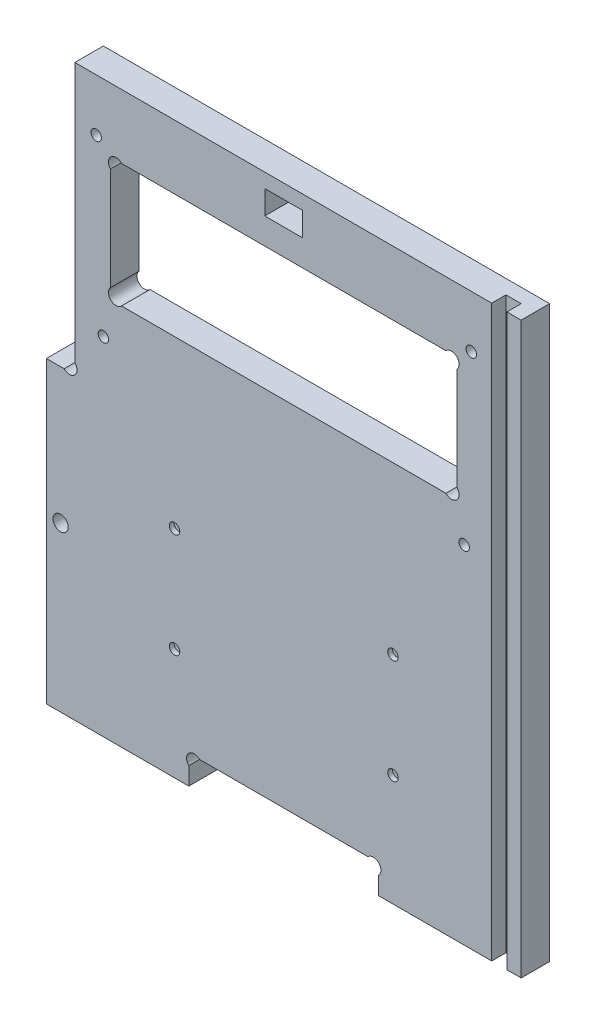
ISO-10303-21;
HEADER;
FILE_DESCRIPTION(('STEP AP214'),'2;1');
FILE_NAME('part.step','',(''),(''),'','','');
FILE_SCHEMA(('AUTOMOTIVE_DESIGN { 1 0 10303 214 1 1 1 1 }'));
ENDSEC;
DATA;
#1=APPLICATION_CONTEXT('core data for automotive mechanical design processes');
#2=APPLICATION_PROTOCOL_DEFINITION('international standard','automotive_design',2000,#1);
#3=PRODUCT_CONTEXT('',#1,'mechanical');
#4=PRODUCT('Part','Part','',(#3));
#5=PRODUCT_RELATED_PRODUCT_CATEGORY('part','',(#4));
#6=PRODUCT_DEFINITION_FORMATION('','',#4);
#7=PRODUCT_DEFINITION_CONTEXT('part definition',#1,'design');
#8=PRODUCT_DEFINITION('design','',#6,#7);
#9=PRODUCT_DEFINITION_SHAPE('','',#8);
#10=(LENGTH_UNIT() NAMED_UNIT(*) SI_UNIT(.MILLI.,.METRE.));
#11=(NAMED_UNIT(*) PLANE_ANGLE_UNIT() SI_UNIT($,.RADIAN.));
#12=(NAMED_UNIT(*) SI_UNIT($,.STERADIAN.) SOLID_ANGLE_UNIT());
#13=UNCERTAINTY_MEASURE_WITH_UNIT(LENGTH_MEASURE(1.E-05),#10,'distance_accuracy_value','');
#14=(GEOMETRIC_REPRESENTATION_CONTEXT(3) GLOBAL_UNCERTAINTY_ASSIGNED_CONTEXT((#13)) GLOBAL_UNIT_ASSIGNED_CONTEXT((#10,
#11,#12)) REPRESENTATION_CONTEXT('',''));
#15=CARTESIAN_POINT('',(0.,0.,0.));
#16=DIRECTION('',(0.,0.,1.));
#17=DIRECTION('',(1.,0.,0.));
#18=AXIS2_PLACEMENT_3D('',#15,#16,#17);
#19=CARTESIAN_POINT('',(18.8686291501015,-1.13137084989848,6.));
#20=DIRECTION('',(0.,0.,1.));
#21=DIRECTION('',(1.,0.,0.));
#22=AXIS2_PLACEMENT_3D('',#19,#20,#21);
#23=PLANE('',#22);
#24=DIRECTION('',(0.,-1.,0.));
#25=VECTOR('',#24,1.);
#26=CARTESIAN_POINT('',(43.8,117.181589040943,6.));
#27=LINE('',#26,#25);
#28=CARTESIAN_POINT('',(43.8,114.,6.));
#29=VERTEX_POINT('',#28);
#30=CARTESIAN_POINT('',(43.8,-5.99999999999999,6.));
#31=VERTEX_POINT('',#30);
#32=EDGE_CURVE('E229',#29,#31,#27,.T.);
#33=ORIENTED_EDGE('',*,*,#32,.F.);
#34=DIRECTION('',(-1.,0.,0.));
#35=VECTOR('',#34,1.);
#36=CARTESIAN_POINT('',(-44.,114.,6.));
#37=LINE('',#36,#35);
#38=CARTESIAN_POINT('',(-44.,114.,6.));
#39=VERTEX_POINT('',#38);
#40=EDGE_CURVE('E239',#29,#39,#37,.T.);
#41=ORIENTED_EDGE('',*,*,#40,.T.);
#42=DIRECTION('',(0.,-1.,0.));
#43=VECTOR('',#42,1.);
#44=CARTESIAN_POINT('',(-44.,59.2627416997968,6.));
#45=LINE('',#44,#43);
#46=CARTESIAN_POINT('',(-44.,59.2627416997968,6.));
#47=VERTEX_POINT('',#46);
#48=EDGE_CURVE('E253',#39,#47,#45,.T.);
#49=ORIENTED_EDGE('',*,*,#48,.T.);
#50=CARTESIAN_POINT('',(-45.1313708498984,58.1313708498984,6.));
#51=DIRECTION('',(0.,0.,-1.));
#52=DIRECTION('',(-1.,0.,0.));
#53=AXIS2_PLACEMENT_3D('',#50,#51,#52);
#54=CIRCLE('',#53,1.59999999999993);
#55=CARTESIAN_POINT('',(-46.2627416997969,57.,6.));
#56=VERTEX_POINT('',#55);
#57=EDGE_CURVE('E258',#47,#56,#54,.T.);
#58=ORIENTED_EDGE('',*,*,#57,.T.);
#59=DIRECTION('',(-1.,0.,0.));
#60=VECTOR('',#59,1.);
#61=CARTESIAN_POINT('',(-46.2627416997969,57.,6.));
#62=LINE('',#61,#60);
#63=CARTESIAN_POINT('',(-50.,57.,6.));
#64=VERTEX_POINT('',#63);
#65=EDGE_CURVE('E260',#56,#64,#62,.T.);
#66=ORIENTED_EDGE('',*,*,#65,.T.);
#67=DIRECTION('',(0.,-1.,0.));
#68=VECTOR('',#67,1.);
#69=CARTESIAN_POINT('',(-50.,57.,6.));
#70=LINE('',#69,#68);
#71=CARTESIAN_POINT('',(-50.,-6.,6.));
#72=VERTEX_POINT('',#71);
#73=EDGE_CURVE('E262',#64,#72,#70,.T.);
#74=ORIENTED_EDGE('',*,*,#73,.T.);
#75=DIRECTION('',(1.,0.,0.));
#76=VECTOR('',#75,1.);
#77=CARTESIAN_POINT('',(-20.,-6.,6.));
#78=LINE('',#77,#76);
#79=CARTESIAN_POINT('',(-20.,-6.,6.));
#80=VERTEX_POINT('',#79);
#81=EDGE_CURVE('E264',#72,#80,#78,.T.);
#82=ORIENTED_EDGE('',*,*,#81,.T.);
#83=DIRECTION('',(0.,1.,0.));
#84=VECTOR('',#83,1.);
#85=CARTESIAN_POINT('',(-20.,-2.26274169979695,6.));
#86=LINE('',#85,#84);
#87=CARTESIAN_POINT('',(-20.,-2.26274169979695,6.));
#88=VERTEX_POINT('',#87);
#89=EDGE_CURVE('E266',#80,#88,#86,.T.);
#90=ORIENTED_EDGE('',*,*,#89,.T.);
#91=CARTESIAN_POINT('',(-18.8686291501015,-1.13137084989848,6.));
#92=DIRECTION('',(0.,0.,-1.));
#93=DIRECTION('',(-1.,0.,0.));
#94=AXIS2_PLACEMENT_3D('',#91,#92,#93);
#95=CIRCLE('',#94,1.6);
#96=CARTESIAN_POINT('',(-17.737258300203,0.,6.));
#97=VERTEX_POINT('',#96);
#98=EDGE_CURVE('E268',#88,#97,#95,.T.);
#99=ORIENTED_EDGE('',*,*,#98,.T.);
#100=DIRECTION('',(1.,0.,0.));
#101=VECTOR('',#100,1.);
#102=CARTESIAN_POINT('',(17.737258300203,0.,6.));
#103=LINE('',#102,#101);
#104=CARTESIAN_POINT('',(17.737258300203,0.,6.));
#105=VERTEX_POINT('',#104);
#106=EDGE_CURVE('E270',#97,#105,#103,.T.);
#107=ORIENTED_EDGE('',*,*,#106,.T.);
#108=CARTESIAN_POINT('',(18.8686291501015,-1.13137084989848,6.));
#109=DIRECTION('',(0.,0.,-1.));
#110=DIRECTION('',(1.,0.,0.));
#111=AXIS2_PLACEMENT_3D('',#108,#109,#110);
#112=CIRCLE('',#111,1.6);
#113=CARTESIAN_POINT('',(20.,-2.26274169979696,6.));
#114=VERTEX_POINT('',#113);
#115=EDGE_CURVE('E272',#105,#114,#112,.T.);
#116=ORIENTED_EDGE('',*,*,#115,.T.);
#117=DIRECTION('',(0.,-1.,0.));
#118=VECTOR('',#117,1.);
#119=CARTESIAN_POINT('',(20.,-6.,6.));
#120=LINE('',#119,#118);
#121=CARTESIAN_POINT('',(20.,-6.,6.));
#122=VERTEX_POINT('',#121);
#123=EDGE_CURVE('E274',#114,#122,#120,.T.);
#124=ORIENTED_EDGE('',*,*,#123,.T.);
#125=DIRECTION('',(1.,0.,0.));
#126=VECTOR('',#125,1.);
#127=CARTESIAN_POINT('',(50.,-6.,6.));
#128=LINE('',#127,#126);
#129=EDGE_CURVE('E242',#122,#31,#128,.T.);
#130=ORIENTED_EDGE('',*,*,#129,.T.);
#131=EDGE_LOOP('',(#33,#41,#49,#58,#66,#74,#82,#90,#99,#107,#116,#124,#130));
#132=FACE_BOUND('',#131,.T.);
#133=CARTESIAN_POINT('',(-23.0000000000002,17.5,6.));
#134=DIRECTION('',(0.,0.,-1.));
#135=DIRECTION('',(-1.,0.,0.));
#136=AXIS2_PLACEMENT_3D('',#133,#134,#135);
#137=CIRCLE('',#136,1.09999999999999);
#138=CARTESIAN_POINT('',(-24.1000000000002,17.5,6.));
#139=VERTEX_POINT('',#138);
#140=EDGE_CURVE('E549',#139,#139,#137,.T.);
#141=ORIENTED_EDGE('',*,*,#140,.T.);
#142=EDGE_LOOP('',(#141));
#143=FACE_BOUND('',#142,.T.);
#144=CARTESIAN_POINT('',(-23.,39.5,6.));
#145=DIRECTION('',(0.,0.,-1.));
#146=DIRECTION('',(-1.,0.,0.));
#147=AXIS2_PLACEMENT_3D('',#144,#145,#146);
#148=CIRCLE('',#147,1.09999999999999);
#149=CARTESIAN_POINT('',(-24.1,39.5,6.));
#150=VERTEX_POINT('',#149);
#151=EDGE_CURVE('E537',#150,#150,#148,.T.);
#152=ORIENTED_EDGE('',*,*,#151,.T.);
#153=EDGE_LOOP('',(#152));
#154=FACE_BOUND('',#153,.T.);
#155=CARTESIAN_POINT('',(-47.,28.5,6.));
#156=DIRECTION('',(0.,0.,1.));
#157=DIRECTION('',(-1.,0.,0.));
#158=AXIS2_PLACEMENT_3D('',#155,#156,#157);
#159=CIRCLE('',#158,1.6);
#160=CARTESIAN_POINT('',(-48.6,28.5,6.));
#161=VERTEX_POINT('',#160);
#162=EDGE_CURVE('E510',#161,#161,#159,.T.);
#163=ORIENTED_EDGE('',*,*,#162,.F.);
#164=EDGE_LOOP('',(#163));
#165=FACE_BOUND('',#164,.T.);
#166=CARTESIAN_POINT('',(38.,67.,6.));
#167=DIRECTION('',(0.,0.,1.));
#168=DIRECTION('',(-1.,0.,0.));
#169=AXIS2_PLACEMENT_3D('',#166,#167,#168);
#170=CIRCLE('',#169,1.1);
#171=CARTESIAN_POINT('',(36.9,67.,6.));
#172=VERTEX_POINT('',#171);
#173=EDGE_CURVE('E454',#172,#172,#170,.T.);
#174=ORIENTED_EDGE('',*,*,#173,.F.);
#175=EDGE_LOOP('',(#174));
#176=FACE_BOUND('',#175,.T.);
#177=CARTESIAN_POINT('',(39.5,103.,6.));
#178=DIRECTION('',(0.,0.,1.));
#179=DIRECTION('',(-1.,0.,0.));
#180=AXIS2_PLACEMENT_3D('',#177,#178,#179);
#181=CIRCLE('',#180,1.1);
#182=CARTESIAN_POINT('',(38.4,103.,6.));
#183=VERTEX_POINT('',#182);
#184=EDGE_CURVE('E422',#183,#183,#181,.T.);
#185=ORIENTED_EDGE('',*,*,#184,.F.);
#186=EDGE_LOOP('',(#185));
#187=FACE_BOUND('',#186,.T.);
#188=CARTESIAN_POINT('',(-39.5,103.,6.));
#189=DIRECTION('',(0.,0.,1.));
#190=DIRECTION('',(1.,0.,0.));
#191=AXIS2_PLACEMENT_3D('',#188,#189,#190);
#192=CIRCLE('',#191,1.1);
#193=CARTESIAN_POINT('',(-38.4,103.,6.));
#194=VERTEX_POINT('',#193);
#195=EDGE_CURVE('E281',#194,#194,#192,.T.);
#196=ORIENTED_EDGE('',*,*,#195,.F.);
#197=EDGE_LOOP('',(#196));
#198=FACE_BOUND('',#197,.T.);
#199=CARTESIAN_POINT('',(-38.,67.,6.));
#200=DIRECTION('',(0.,0.,1.));
#201=DIRECTION('',(1.,0.,0.));
#202=AXIS2_PLACEMENT_3D('',#199,#200,#201);
#203=CIRCLE('',#202,1.1);
#204=CARTESIAN_POINT('',(-36.9,67.,6.));
#205=VERTEX_POINT('',#204);
#206=EDGE_CURVE('E416',#205,#205,#203,.T.);
#207=ORIENTED_EDGE('',*,*,#206,.F.);
#208=EDGE_LOOP('',(#207));
#209=FACE_BOUND('',#208,.T.);
#210=DIRECTION('',(1.,0.,0.));
#211=VECTOR('',#210,1.);
#212=CARTESIAN_POINT('',(3.99999999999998,106.,6.));
#213=LINE('',#212,#211);
#214=CARTESIAN_POINT('',(-4.00000000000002,106.,6.));
#215=VERTEX_POINT('',#214);
#216=CARTESIAN_POINT('',(3.99999999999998,106.,6.));
#217=VERTEX_POINT('',#216);
#218=EDGE_CURVE('E459',#215,#217,#213,.T.);
#219=ORIENTED_EDGE('',*,*,#218,.F.);
#220=DIRECTION('',(0.,-1.,0.));
#221=VECTOR('',#220,1.);
#222=CARTESIAN_POINT('',(-4.00000000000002,111.,6.));
#223=LINE('',#222,#221);
#224=CARTESIAN_POINT('',(-4.00000000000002,111.,6.));
#225=VERTEX_POINT('',#224);
#226=EDGE_CURVE('E444',#225,#215,#223,.T.);
#227=ORIENTED_EDGE('',*,*,#226,.F.);
#228=DIRECTION('',(-1.,0.,0.));
#229=VECTOR('',#228,1.);
#230=CARTESIAN_POINT('',(3.99999999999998,111.,6.));
#231=LINE('',#230,#229);
#232=CARTESIAN_POINT('',(3.99999999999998,111.,6.));
#233=VERTEX_POINT('',#232);
#234=EDGE_CURVE('E440',#233,#225,#231,.T.);
#235=ORIENTED_EDGE('',*,*,#234,.F.);
#236=DIRECTION('',(0.,1.,0.));
#237=VECTOR('',#236,1.);
#238=CARTESIAN_POINT('',(3.99999999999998,111.,6.));
#239=LINE('',#238,#237);
#240=EDGE_CURVE('E456',#217,#233,#239,.T.);
#241=ORIENTED_EDGE('',*,*,#240,.F.);
#242=EDGE_LOOP('',(#219,#227,#235,#241));
#243=FACE_BOUND('',#242,.T.);
#244=DIRECTION('',(-1.,0.,0.));
#245=VECTOR('',#244,1.);
#246=CARTESIAN_POINT('',(-34.1591949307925,100.5,6.));
#247=LINE('',#246,#245);
#248=CARTESIAN_POINT('',(34.1591949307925,100.5,6.));
#249=VERTEX_POINT('',#248);
#250=CARTESIAN_POINT('',(-34.1591949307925,100.5,6.));
#251=VERTEX_POINT('',#250);
#252=EDGE_CURVE('E522',#249,#251,#247,.T.);
#253=ORIENTED_EDGE('',*,*,#252,.F.);
#254=CARTESIAN_POINT('',(35.3295974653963,99.4090564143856,6.));
#255=DIRECTION('',(0.,0.,1.));
#256=DIRECTION('',(1.,0.,0.));
#257=AXIS2_PLACEMENT_3D('',#254,#255,#256);
#258=CIRCLE('',#257,1.6);
#259=CARTESIAN_POINT('',(36.5,98.3181128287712,6.));
#260=VERTEX_POINT('',#259);
#261=EDGE_CURVE('E488',#260,#249,#258,.T.);
#262=ORIENTED_EDGE('',*,*,#261,.F.);
#263=DIRECTION('',(0.,1.,0.));
#264=VECTOR('',#263,1.);
#265=CARTESIAN_POINT('',(36.5,98.3181128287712,6.));
#266=LINE('',#265,#264);
#267=CARTESIAN_POINT('',(36.5,76.6818871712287,6.));
#268=VERTEX_POINT('',#267);
#269=EDGE_CURVE('E484',#268,#260,#266,.T.);
#270=ORIENTED_EDGE('',*,*,#269,.F.);
#271=CARTESIAN_POINT('',(35.3295974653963,75.5909435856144,6.));
#272=DIRECTION('',(0.,0.,1.));
#273=DIRECTION('',(-1.,0.,0.));
#274=AXIS2_PLACEMENT_3D('',#271,#272,#273);
#275=CIRCLE('',#274,1.6);
#276=CARTESIAN_POINT('',(34.1591949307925,74.5,6.));
#277=VERTEX_POINT('',#276);
#278=EDGE_CURVE('E512',#277,#268,#275,.T.);
#279=ORIENTED_EDGE('',*,*,#278,.F.);
#280=DIRECTION('',(1.,0.,0.));
#281=VECTOR('',#280,1.);
#282=CARTESIAN_POINT('',(-34.1591949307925,74.5,6.));
#283=LINE('',#282,#281);
#284=CARTESIAN_POINT('',(-34.1591949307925,74.5,6.));
#285=VERTEX_POINT('',#284);
#286=EDGE_CURVE('E514',#285,#277,#283,.T.);
#287=ORIENTED_EDGE('',*,*,#286,.F.);
#288=CARTESIAN_POINT('',(-35.3295974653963,75.5909435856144,6.));
#289=DIRECTION('',(0.,0.,1.));
#290=DIRECTION('',(1.,0.,0.));
#291=AXIS2_PLACEMENT_3D('',#288,#289,#290);
#292=CIRCLE('',#291,1.6);
#293=CARTESIAN_POINT('',(-36.5,76.6818871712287,6.));
#294=VERTEX_POINT('',#293);
#295=EDGE_CURVE('E516',#294,#285,#292,.T.);
#296=ORIENTED_EDGE('',*,*,#295,.F.);
#297=DIRECTION('',(0.,-1.,0.));
#298=VECTOR('',#297,1.);
#299=CARTESIAN_POINT('',(-36.5,98.3181128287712,6.));
#300=LINE('',#299,#298);
#301=CARTESIAN_POINT('',(-36.5,98.3181128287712,6.));
#302=VERTEX_POINT('',#301);
#303=EDGE_CURVE('E518',#302,#294,#300,.T.);
#304=ORIENTED_EDGE('',*,*,#303,.F.);
#305=CARTESIAN_POINT('',(-35.3295974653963,99.4090564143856,6.));
#306=DIRECTION('',(0.,0.,1.));
#307=DIRECTION('',(-1.,0.,0.));
#308=AXIS2_PLACEMENT_3D('',#305,#306,#307);
#309=CIRCLE('',#308,1.6);
#310=EDGE_CURVE('E520',#251,#302,#309,.T.);
#311=ORIENTED_EDGE('',*,*,#310,.F.);
#312=EDGE_LOOP('',(#253,#262,#270,#279,#287,#296,#304,#311));
#313=FACE_BOUND('',#312,.T.);
#314=CARTESIAN_POINT('',(23.,39.5,6.));
#315=DIRECTION('',(0.,0.,-1.));
#316=DIRECTION('',(-1.,0.,0.));
#317=AXIS2_PLACEMENT_3D('',#314,#315,#316);
#318=CIRCLE('',#317,1.09999999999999);
#319=CARTESIAN_POINT('',(21.9,39.5,6.));
#320=VERTEX_POINT('',#319);
#321=EDGE_CURVE('E531',#320,#320,#318,.T.);
#322=ORIENTED_EDGE('',*,*,#321,.T.);
#323=EDGE_LOOP('',(#322));
#324=FACE_BOUND('',#323,.T.);
#325=CARTESIAN_POINT('',(22.9999999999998,17.5,6.));
#326=DIRECTION('',(0.,0.,-1.));
#327=DIRECTION('',(-1.,0.,0.));
#328=AXIS2_PLACEMENT_3D('',#325,#326,#327);
#329=CIRCLE('',#328,1.09999999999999);
#330=CARTESIAN_POINT('',(21.8999999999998,17.5,6.));
#331=VERTEX_POINT('',#330);
#332=EDGE_CURVE('E543',#331,#331,#329,.T.);
#333=ORIENTED_EDGE('',*,*,#332,.T.);
#334=EDGE_LOOP('',(#333));
#335=FACE_BOUND('',#334,.T.);
#336=ADVANCED_FACE('F37',(#132,#143,#154,#165,#176,#187,#198,#209,#243,#313,#324,#335),#23,.T.);
#337=DIRECTION('',(0.,1.,0.));
#338=VECTOR('',#337,1.);
#339=CARTESIAN_POINT('',(47.,117.181589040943,6.));
#340=LINE('',#339,#338);
#341=CARTESIAN_POINT('',(47.,-5.99999999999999,6.));
#342=VERTEX_POINT('',#341);
#343=CARTESIAN_POINT('',(47.,114.,6.));
#344=VERTEX_POINT('',#343);
#345=EDGE_CURVE('E243',#342,#344,#340,.T.);
#346=ORIENTED_EDGE('',*,*,#345,.F.);
#347=CARTESIAN_POINT('',(50.,-6.,6.));
#348=VERTEX_POINT('',#347);
#349=EDGE_CURVE('E305',#342,#348,#128,.T.);
#350=ORIENTED_EDGE('',*,*,#349,.T.);
#351=DIRECTION('',(0.,1.,0.));
#352=VECTOR('',#351,1.);
#353=CARTESIAN_POINT('',(50.,114.,6.));
#354=LINE('',#353,#352);
#355=CARTESIAN_POINT('',(50.,114.,6.));
#356=VERTEX_POINT('',#355);
#357=EDGE_CURVE('E250',#348,#356,#354,.T.);
#358=ORIENTED_EDGE('',*,*,#357,.T.);
#359=EDGE_CURVE('E249',#356,#344,#37,.T.);
#360=ORIENTED_EDGE('',*,*,#359,.T.);
#361=EDGE_LOOP('',(#346,#350,#358,#360));
#362=FACE_BOUND('',#361,.T.);
#363=ADVANCED_FACE('F348',(#362),#23,.T.);
#364=CARTESIAN_POINT('',(18.8686291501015,-1.13137084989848,0.));
#365=DIRECTION('',(0.,0.,1.));
#366=DIRECTION('',(1.,0.,0.));
#367=AXIS2_PLACEMENT_3D('',#364,#365,#366);
#368=PLANE('',#367);
#369=CARTESIAN_POINT('',(35.3295974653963,99.4090564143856,0.));
#370=DIRECTION('',(0.,0.,1.));
#371=DIRECTION('',(1.,0.,0.));
#372=AXIS2_PLACEMENT_3D('',#369,#370,#371);
#373=CIRCLE('',#372,1.6);
#374=CARTESIAN_POINT('',(36.5,98.3181128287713,0.));
#375=VERTEX_POINT('',#374);
#376=CARTESIAN_POINT('',(34.1591949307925,100.5,0.));
#377=VERTEX_POINT('',#376);
#378=EDGE_CURVE('E507',#375,#377,#373,.T.);
#379=ORIENTED_EDGE('',*,*,#378,.T.);
#380=DIRECTION('',(-1.,0.,0.));
#381=VECTOR('',#380,1.);
#382=CARTESIAN_POINT('',(-34.1591949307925,100.5,0.));
#383=LINE('',#382,#381);
#384=CARTESIAN_POINT('',(-34.1591949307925,100.5,0.));
#385=VERTEX_POINT('',#384);
#386=EDGE_CURVE('E504',#377,#385,#383,.T.);
#387=ORIENTED_EDGE('',*,*,#386,.T.);
#388=CARTESIAN_POINT('',(-35.3295974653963,99.4090564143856,0.));
#389=DIRECTION('',(0.,0.,1.));
#390=DIRECTION('',(-1.,0.,0.));
#391=AXIS2_PLACEMENT_3D('',#388,#389,#390);
#392=CIRCLE('',#391,1.6);
#393=CARTESIAN_POINT('',(-36.5,98.3181128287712,0.));
#394=VERTEX_POINT('',#393);
#395=EDGE_CURVE('E501',#385,#394,#392,.T.);
#396=ORIENTED_EDGE('',*,*,#395,.T.);
#397=DIRECTION('',(0.,-1.,0.));
#398=VECTOR('',#397,1.);
#399=CARTESIAN_POINT('',(-36.5,98.3181128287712,0.));
#400=LINE('',#399,#398);
#401=CARTESIAN_POINT('',(-36.5,76.6818871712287,0.));
#402=VERTEX_POINT('',#401);
#403=EDGE_CURVE('E498',#394,#402,#400,.T.);
#404=ORIENTED_EDGE('',*,*,#403,.T.);
#405=CARTESIAN_POINT('',(-35.3295974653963,75.5909435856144,0.));
#406=DIRECTION('',(0.,0.,1.));
#407=DIRECTION('',(1.,0.,0.));
#408=AXIS2_PLACEMENT_3D('',#405,#406,#407);
#409=CIRCLE('',#408,1.6);
#410=CARTESIAN_POINT('',(-34.1591949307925,74.5,0.));
#411=VERTEX_POINT('',#410);
#412=EDGE_CURVE('E495',#402,#411,#409,.T.);
#413=ORIENTED_EDGE('',*,*,#412,.T.);
#414=DIRECTION('',(1.,0.,0.));
#415=VECTOR('',#414,1.);
#416=CARTESIAN_POINT('',(-34.1591949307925,74.5,0.));
#417=LINE('',#416,#415);
#418=CARTESIAN_POINT('',(34.1591949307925,74.5,0.));
#419=VERTEX_POINT('',#418);
#420=EDGE_CURVE('E492',#411,#419,#417,.T.);
#421=ORIENTED_EDGE('',*,*,#420,.T.);
#422=CARTESIAN_POINT('',(35.3295974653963,75.5909435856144,0.));
#423=DIRECTION('',(0.,0.,1.));
#424=DIRECTION('',(-1.,0.,0.));
#425=AXIS2_PLACEMENT_3D('',#422,#423,#424);
#426=CIRCLE('',#425,1.6);
#427=CARTESIAN_POINT('',(36.5,76.6818871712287,0.));
#428=VERTEX_POINT('',#427);
#429=EDGE_CURVE('E489',#419,#428,#426,.T.);
#430=ORIENTED_EDGE('',*,*,#429,.T.);
#431=DIRECTION('',(0.,1.,0.));
#432=VECTOR('',#431,1.);
#433=CARTESIAN_POINT('',(36.5,98.3181128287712,0.));
#434=LINE('',#433,#432);
#435=EDGE_CURVE('E485',#428,#375,#434,.T.);
#436=ORIENTED_EDGE('',*,*,#435,.T.);
#437=EDGE_LOOP('',(#379,#387,#396,#404,#413,#421,#430,#436));
#438=FACE_BOUND('',#437,.T.);
#439=DIRECTION('',(0.,-1.,0.));
#440=VECTOR('',#439,1.);
#441=CARTESIAN_POINT('',(-4.00000000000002,111.,0.));
#442=LINE('',#441,#440);
#443=CARTESIAN_POINT('',(-4.00000000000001,111.,0.));
#444=VERTEX_POINT('',#443);
#445=CARTESIAN_POINT('',(-4.00000000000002,106.,0.));
#446=VERTEX_POINT('',#445);
#447=EDGE_CURVE('E451',#444,#446,#442,.T.);
#448=ORIENTED_EDGE('',*,*,#447,.T.);
#449=DIRECTION('',(1.,0.,0.));
#450=VECTOR('',#449,1.);
#451=CARTESIAN_POINT('',(3.99999999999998,106.,0.));
#452=LINE('',#451,#450);
#453=CARTESIAN_POINT('',(3.99999999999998,106.,0.));
#454=VERTEX_POINT('',#453);
#455=EDGE_CURVE('E448',#446,#454,#452,.T.);
#456=ORIENTED_EDGE('',*,*,#455,.T.);
#457=DIRECTION('',(0.,1.,0.));
#458=VECTOR('',#457,1.);
#459=CARTESIAN_POINT('',(3.99999999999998,111.,0.));
#460=LINE('',#459,#458);
#461=CARTESIAN_POINT('',(3.99999999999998,111.,0.));
#462=VERTEX_POINT('',#461);
#463=EDGE_CURVE('E445',#454,#462,#460,.T.);
#464=ORIENTED_EDGE('',*,*,#463,.T.);
#465=DIRECTION('',(-1.,0.,0.));
#466=VECTOR('',#465,1.);
#467=CARTESIAN_POINT('',(3.99999999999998,111.,0.));
#468=LINE('',#467,#466);
#469=EDGE_CURVE('E441',#462,#444,#468,.T.);
#470=ORIENTED_EDGE('',*,*,#469,.T.);
#471=EDGE_LOOP('',(#448,#456,#464,#470));
#472=FACE_BOUND('',#471,.T.);
#473=CARTESIAN_POINT('',(-38.,67.,0.));
#474=DIRECTION('',(0.,0.,1.));
#475=DIRECTION('',(1.,0.,0.));
#476=AXIS2_PLACEMENT_3D('',#473,#474,#475);
#477=CIRCLE('',#476,1.1);
#478=CARTESIAN_POINT('',(-36.9,67.,0.));
#479=VERTEX_POINT('',#478);
#480=EDGE_CURVE('E419',#479,#479,#477,.T.);
#481=ORIENTED_EDGE('',*,*,#480,.T.);
#482=EDGE_LOOP('',(#481));
#483=FACE_BOUND('',#482,.T.);
#484=DIRECTION('',(1.,0.,0.));
#485=VECTOR('',#484,1.);
#486=CARTESIAN_POINT('',(50.,-6.,0.));
#487=LINE('',#486,#485);
#488=CARTESIAN_POINT('',(20.,-6.,0.));
#489=VERTEX_POINT('',#488);
#490=CARTESIAN_POINT('',(50.,-6.,0.));
#491=VERTEX_POINT('',#490);
#492=EDGE_CURVE('E277',#489,#491,#487,.T.);
#493=ORIENTED_EDGE('',*,*,#492,.F.);
#494=DIRECTION('',(0.,-1.,0.));
#495=VECTOR('',#494,1.);
#496=CARTESIAN_POINT('',(20.,-6.,0.));
#497=LINE('',#496,#495);
#498=CARTESIAN_POINT('',(20.,-2.26274169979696,0.));
#499=VERTEX_POINT('',#498);
#500=EDGE_CURVE('E303',#499,#489,#497,.T.);
#501=ORIENTED_EDGE('',*,*,#500,.F.);
#502=CARTESIAN_POINT('',(18.8686291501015,-1.13137084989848,0.));
#503=DIRECTION('',(0.,0.,-1.));
#504=DIRECTION('',(1.,0.,0.));
#505=AXIS2_PLACEMENT_3D('',#502,#503,#504);
#506=CIRCLE('',#505,1.6);
#507=CARTESIAN_POINT('',(17.737258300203,0.,0.));
#508=VERTEX_POINT('',#507);
#509=EDGE_CURVE('E301',#508,#499,#506,.T.);
#510=ORIENTED_EDGE('',*,*,#509,.F.);
#511=DIRECTION('',(1.,0.,0.));
#512=VECTOR('',#511,1.);
#513=CARTESIAN_POINT('',(17.737258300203,0.,0.));
#514=LINE('',#513,#512);
#515=CARTESIAN_POINT('',(-17.737258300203,0.,0.));
#516=VERTEX_POINT('',#515);
#517=EDGE_CURVE('E299',#516,#508,#514,.T.);
#518=ORIENTED_EDGE('',*,*,#517,.F.);
#519=CARTESIAN_POINT('',(-18.8686291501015,-1.13137084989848,0.));
#520=DIRECTION('',(0.,0.,-1.));
#521=DIRECTION('',(-1.,0.,0.));
#522=AXIS2_PLACEMENT_3D('',#519,#520,#521);
#523=CIRCLE('',#522,1.6);
#524=CARTESIAN_POINT('',(-20.,-2.26274169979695,0.));
#525=VERTEX_POINT('',#524);
#526=EDGE_CURVE('E297',#525,#516,#523,.T.);
#527=ORIENTED_EDGE('',*,*,#526,.F.);
#528=DIRECTION('',(0.,1.,0.));
#529=VECTOR('',#528,1.);
#530=CARTESIAN_POINT('',(-20.,-2.26274169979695,0.));
#531=LINE('',#530,#529);
#532=CARTESIAN_POINT('',(-20.,-6.,0.));
#533=VERTEX_POINT('',#532);
#534=EDGE_CURVE('E295',#533,#525,#531,.T.);
#535=ORIENTED_EDGE('',*,*,#534,.F.);
#536=DIRECTION('',(1.,0.,0.));
#537=VECTOR('',#536,1.);
#538=CARTESIAN_POINT('',(-20.,-6.,0.));
#539=LINE('',#538,#537);
#540=CARTESIAN_POINT('',(-50.,-6.,0.));
#541=VERTEX_POINT('',#540);
#542=EDGE_CURVE('E293',#541,#533,#539,.T.);
#543=ORIENTED_EDGE('',*,*,#542,.F.);
#544=DIRECTION('',(0.,-1.,0.));
#545=VECTOR('',#544,1.);
#546=CARTESIAN_POINT('',(-50.,57.,0.));
#547=LINE('',#546,#545);
#548=CARTESIAN_POINT('',(-50.,57.,0.));
#549=VERTEX_POINT('',#548);
#550=EDGE_CURVE('E291',#549,#541,#547,.T.);
#551=ORIENTED_EDGE('',*,*,#550,.F.);
#552=DIRECTION('',(-1.,0.,0.));
#553=VECTOR('',#552,1.);
#554=CARTESIAN_POINT('',(-46.2627416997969,57.,0.));
#555=LINE('',#554,#553);
#556=CARTESIAN_POINT('',(-46.2627416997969,57.,0.));
#557=VERTEX_POINT('',#556);
#558=EDGE_CURVE('E289',#557,#549,#555,.T.);
#559=ORIENTED_EDGE('',*,*,#558,.F.);
#560=CARTESIAN_POINT('',(-45.1313708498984,58.1313708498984,0.));
#561=DIRECTION('',(0.,0.,-1.));
#562=DIRECTION('',(-1.,0.,0.));
#563=AXIS2_PLACEMENT_3D('',#560,#561,#562);
#564=CIRCLE('',#563,1.59999999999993);
#565=CARTESIAN_POINT('',(-44.,59.2627416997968,0.));
#566=VERTEX_POINT('',#565);
#567=EDGE_CURVE('E287',#566,#557,#564,.T.);
#568=ORIENTED_EDGE('',*,*,#567,.F.);
#569=DIRECTION('',(0.,-1.,0.));
#570=VECTOR('',#569,1.);
#571=CARTESIAN_POINT('',(-44.,59.2627416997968,0.));
#572=LINE('',#571,#570);
#573=CARTESIAN_POINT('',(-44.,114.,0.));
#574=VERTEX_POINT('',#573);
#575=EDGE_CURVE('E285',#574,#566,#572,.T.);
#576=ORIENTED_EDGE('',*,*,#575,.F.);
#577=DIRECTION('',(-1.,0.,0.));
#578=VECTOR('',#577,1.);
#579=CARTESIAN_POINT('',(-44.,114.,0.));
#580=LINE('',#579,#578);
#581=CARTESIAN_POINT('',(50.,114.,0.));
#582=VERTEX_POINT('',#581);
#583=EDGE_CURVE('E283',#582,#574,#580,.T.);
#584=ORIENTED_EDGE('',*,*,#583,.F.);
#585=DIRECTION('',(0.,1.,0.));
#586=VECTOR('',#585,1.);
#587=CARTESIAN_POINT('',(50.,114.,0.));
#588=LINE('',#587,#586);
#589=EDGE_CURVE('E280',#491,#582,#588,.T.);
#590=ORIENTED_EDGE('',*,*,#589,.F.);
#591=EDGE_LOOP('',(#493,#501,#510,#518,#527,#535,#543,#551,#559,#568,#576,#584,#590));
#592=FACE_BOUND('',#591,.T.);
#593=CARTESIAN_POINT('',(-39.5,103.,0.));
#594=DIRECTION('',(0.,0.,1.));
#595=DIRECTION('',(1.,0.,0.));
#596=AXIS2_PLACEMENT_3D('',#593,#594,#595);
#597=CIRCLE('',#596,1.1);
#598=CARTESIAN_POINT('',(-38.4,103.,0.));
#599=VERTEX_POINT('',#598);
#600=EDGE_CURVE('E413',#599,#599,#597,.T.);
#601=ORIENTED_EDGE('',*,*,#600,.T.);
#602=EDGE_LOOP('',(#601));
#603=FACE_BOUND('',#602,.T.);
#604=CARTESIAN_POINT('',(39.5,103.,0.));
#605=DIRECTION('',(0.,0.,1.));
#606=DIRECTION('',(-1.,0.,0.));
#607=AXIS2_PLACEMENT_3D('',#604,#605,#606);
#608=CIRCLE('',#607,1.1);
#609=CARTESIAN_POINT('',(38.4,103.,0.));
#610=VERTEX_POINT('',#609);
#611=EDGE_CURVE('E425',#610,#610,#608,.T.);
#612=ORIENTED_EDGE('',*,*,#611,.T.);
#613=EDGE_LOOP('',(#612));
#614=FACE_BOUND('',#613,.T.);
#615=CARTESIAN_POINT('',(38.,67.,0.));
#616=DIRECTION('',(0.,0.,1.));
#617=DIRECTION('',(-1.,0.,0.));
#618=AXIS2_PLACEMENT_3D('',#615,#616,#617);
#619=CIRCLE('',#618,1.1);
#620=CARTESIAN_POINT('',(36.9,67.,0.));
#621=VERTEX_POINT('',#620);
#622=EDGE_CURVE('E462',#621,#621,#619,.T.);
#623=ORIENTED_EDGE('',*,*,#622,.T.);
#624=EDGE_LOOP('',(#623));
#625=FACE_BOUND('',#624,.T.);
#626=CARTESIAN_POINT('',(-47.,28.5,0.));
#627=DIRECTION('',(0.,0.,1.));
#628=DIRECTION('',(-1.,0.,0.));
#629=AXIS2_PLACEMENT_3D('',#626,#627,#628);
#630=CIRCLE('',#629,1.6);
#631=CARTESIAN_POINT('',(-48.6,28.5,0.));
#632=VERTEX_POINT('',#631);
#633=EDGE_CURVE('E525',#632,#632,#630,.T.);
#634=ORIENTED_EDGE('',*,*,#633,.T.);
#635=EDGE_LOOP('',(#634));
#636=FACE_BOUND('',#635,.T.);
#637=ADVANCED_FACE('F359',(#438,#472,#483,#592,#603,#614,#625,#636),#368,.F.);
#638=CARTESIAN_POINT('',(50.,-6.,6.));
#639=DIRECTION('',(0.,1.,0.));
#640=DIRECTION('',(-1.,0.,0.));
#641=AXIS2_PLACEMENT_3D('',#638,#639,#640);
#642=PLANE('',#641);
#643=DIRECTION('',(1.,0.,0.));
#644=VECTOR('',#643,1.);
#645=CARTESIAN_POINT('',(50.,-6.,3.));
#646=LINE('',#645,#644);
#647=CARTESIAN_POINT('',(43.8,-5.99999999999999,3.));
#648=VERTEX_POINT('',#647);
#649=CARTESIAN_POINT('',(47.,-5.99999999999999,3.));
#650=VERTEX_POINT('',#649);
#651=EDGE_CURVE('E558',#648,#650,#646,.T.);
#652=ORIENTED_EDGE('',*,*,#651,.F.);
#653=DIRECTION('',(0.,0.,1.));
#654=VECTOR('',#653,1.);
#655=CARTESIAN_POINT('',(43.8,-6.,6.));
#656=LINE('',#655,#654);
#657=EDGE_CURVE('E411',#648,#31,#656,.T.);
#658=ORIENTED_EDGE('',*,*,#657,.T.);
#659=ORIENTED_EDGE('',*,*,#129,.F.);
#660=DIRECTION('',(0.,0.,-1.));
#661=VECTOR('',#660,1.);
#662=CARTESIAN_POINT('',(20.,-6.,6.));
#663=LINE('',#662,#661);
#664=EDGE_CURVE('E276',#122,#489,#663,.T.);
#665=ORIENTED_EDGE('',*,*,#664,.T.);
#666=ORIENTED_EDGE('',*,*,#492,.T.);
#667=DIRECTION('',(0.,0.,-1.));
#668=VECTOR('',#667,1.);
#669=CARTESIAN_POINT('',(50.,-6.,6.));
#670=LINE('',#669,#668);
#671=EDGE_CURVE('E339',#348,#491,#670,.T.);
#672=ORIENTED_EDGE('',*,*,#671,.F.);
#673=ORIENTED_EDGE('',*,*,#349,.F.);
#674=DIRECTION('',(0.,0.,-1.));
#675=VECTOR('',#674,1.);
#676=CARTESIAN_POINT('',(47.,-6.,6.));
#677=LINE('',#676,#675);
#678=EDGE_CURVE('E555',#342,#650,#677,.T.);
#679=ORIENTED_EDGE('',*,*,#678,.T.);
#680=EDGE_LOOP('',(#652,#658,#659,#665,#666,#672,#673,#679));
#681=FACE_BOUND('',#680,.T.);
#682=ADVANCED_FACE('F39',(#681),#642,.F.);
#683=CARTESIAN_POINT('',(50.,114.,6.));
#684=DIRECTION('',(-1.,0.,0.));
#685=DIRECTION('',(0.,0.,1.));
#686=AXIS2_PLACEMENT_3D('',#683,#684,#685);
#687=PLANE('',#686);
#688=ORIENTED_EDGE('',*,*,#589,.T.);
#689=DIRECTION('',(0.,0.,-1.));
#690=VECTOR('',#689,1.);
#691=CARTESIAN_POINT('',(50.,114.,6.));
#692=LINE('',#691,#690);
#693=EDGE_CURVE('E336',#356,#582,#692,.T.);
#694=ORIENTED_EDGE('',*,*,#693,.F.);
#695=ORIENTED_EDGE('',*,*,#357,.F.);
#696=ORIENTED_EDGE('',*,*,#671,.T.);
#697=EDGE_LOOP('',(#688,#694,#695,#696));
#698=FACE_BOUND('',#697,.T.);
#699=ADVANCED_FACE('F354',(#698),#687,.F.);
#700=CARTESIAN_POINT('',(-44.,114.,6.));
#701=DIRECTION('',(0.,-1.,0.));
#702=DIRECTION('',(0.,0.,-1.));
#703=AXIS2_PLACEMENT_3D('',#700,#701,#702);
#704=PLANE('',#703);
#705=ORIENTED_EDGE('',*,*,#40,.F.);
#706=DIRECTION('',(0.,0.,-1.));
#707=VECTOR('',#706,1.);
#708=CARTESIAN_POINT('',(43.8,114.,6.));
#709=LINE('',#708,#707);
#710=CARTESIAN_POINT('',(43.8,114.,3.));
#711=VERTEX_POINT('',#710);
#712=EDGE_CURVE('E11',#29,#711,#709,.T.);
#713=ORIENTED_EDGE('',*,*,#712,.T.);
#714=DIRECTION('',(-1.,0.,0.));
#715=VECTOR('',#714,1.);
#716=CARTESIAN_POINT('',(-44.,114.,3.));
#717=LINE('',#716,#715);
#718=CARTESIAN_POINT('',(47.,114.,3.));
#719=VERTEX_POINT('',#718);
#720=EDGE_CURVE('E342',#719,#711,#717,.T.);
#721=ORIENTED_EDGE('',*,*,#720,.F.);
#722=DIRECTION('',(0.,0.,1.));
#723=VECTOR('',#722,1.);
#724=CARTESIAN_POINT('',(47.,114.,6.));
#725=LINE('',#724,#723);
#726=EDGE_CURVE('E45',#719,#344,#725,.T.);
#727=ORIENTED_EDGE('',*,*,#726,.T.);
#728=ORIENTED_EDGE('',*,*,#359,.F.);
#729=ORIENTED_EDGE('',*,*,#693,.T.);
#730=ORIENTED_EDGE('',*,*,#583,.T.);
#731=DIRECTION('',(0.,0.,-1.));
#732=VECTOR('',#731,1.);
#733=CARTESIAN_POINT('',(-44.,114.,6.));
#734=LINE('',#733,#732);
#735=EDGE_CURVE('E247',#39,#574,#734,.T.);
#736=ORIENTED_EDGE('',*,*,#735,.F.);
#737=EDGE_LOOP('',(#705,#713,#721,#727,#728,#729,#730,#736));
#738=FACE_BOUND('',#737,.T.);
#739=ADVANCED_FACE('F245',(#738),#704,.F.);
#740=CARTESIAN_POINT('',(-44.,59.2627416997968,6.));
#741=DIRECTION('',(1.,0.,0.));
#742=DIRECTION('',(0.,0.,-1.));
#743=AXIS2_PLACEMENT_3D('',#740,#741,#742);
#744=PLANE('',#743);
#745=ORIENTED_EDGE('',*,*,#575,.T.);
#746=DIRECTION('',(0.,0.,-1.));
#747=VECTOR('',#746,1.);
#748=CARTESIAN_POINT('',(-44.,59.2627416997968,6.));
#749=LINE('',#748,#747);
#750=EDGE_CURVE('E332',#47,#566,#749,.T.);
#751=ORIENTED_EDGE('',*,*,#750,.F.);
#752=ORIENTED_EDGE('',*,*,#48,.F.);
#753=ORIENTED_EDGE('',*,*,#735,.T.);
#754=EDGE_LOOP('',(#745,#751,#752,#753));
#755=FACE_BOUND('',#754,.T.);
#756=ADVANCED_FACE('F365',(#755),#744,.F.);
#757=CARTESIAN_POINT('',(-45.1313708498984,58.1313708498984,6.));
#758=DIRECTION('',(0.,0.,-1.));
#759=DIRECTION('',(-1.,0.,0.));
#760=AXIS2_PLACEMENT_3D('',#757,#758,#759);
#761=CYLINDRICAL_SURFACE('',#760,1.59999999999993);
#762=ORIENTED_EDGE('',*,*,#567,.T.);
#763=DIRECTION('',(0.,0.,-1.));
#764=VECTOR('',#763,1.);
#765=CARTESIAN_POINT('',(-46.2627416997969,57.,6.));
#766=LINE('',#765,#764);
#767=EDGE_CURVE('E329',#56,#557,#766,.T.);
#768=ORIENTED_EDGE('',*,*,#767,.F.);
#769=ORIENTED_EDGE('',*,*,#57,.F.);
#770=ORIENTED_EDGE('',*,*,#750,.T.);
#771=EDGE_LOOP('',(#762,#768,#769,#770));
#772=FACE_BOUND('',#771,.T.);
#773=ADVANCED_FACE('F368',(#772),#761,.F.);
#774=CARTESIAN_POINT('',(-46.2627416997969,57.,6.));
#775=DIRECTION('',(0.,-1.,0.));
#776=DIRECTION('',(0.,0.,-1.));
#777=AXIS2_PLACEMENT_3D('',#774,#775,#776);
#778=PLANE('',#777);
#779=ORIENTED_EDGE('',*,*,#558,.T.);
#780=DIRECTION('',(0.,0.,-1.));
#781=VECTOR('',#780,1.);
#782=CARTESIAN_POINT('',(-50.,57.,6.));
#783=LINE('',#782,#781);
#784=EDGE_CURVE('E326',#64,#549,#783,.T.);
#785=ORIENTED_EDGE('',*,*,#784,.F.);
#786=ORIENTED_EDGE('',*,*,#65,.F.);
#787=ORIENTED_EDGE('',*,*,#767,.T.);
#788=EDGE_LOOP('',(#779,#785,#786,#787));
#789=FACE_BOUND('',#788,.T.);
#790=ADVANCED_FACE('F375',(#789),#778,.F.);
#791=CARTESIAN_POINT('',(-50.,57.,6.));
#792=DIRECTION('',(1.,0.,0.));
#793=DIRECTION('',(0.,0.,-1.));
#794=AXIS2_PLACEMENT_3D('',#791,#792,#793);
#795=PLANE('',#794);
#796=ORIENTED_EDGE('',*,*,#550,.T.);
#797=DIRECTION('',(0.,0.,-1.));
#798=VECTOR('',#797,1.);
#799=CARTESIAN_POINT('',(-50.,-6.,6.));
#800=LINE('',#799,#798);
#801=EDGE_CURVE('E323',#72,#541,#800,.T.);
#802=ORIENTED_EDGE('',*,*,#801,.F.);
#803=ORIENTED_EDGE('',*,*,#73,.F.);
#804=ORIENTED_EDGE('',*,*,#784,.T.);
#805=EDGE_LOOP('',(#796,#802,#803,#804));
#806=FACE_BOUND('',#805,.T.);
#807=ADVANCED_FACE('F378',(#806),#795,.F.);
#808=CARTESIAN_POINT('',(-20.,-6.,6.));
#809=DIRECTION('',(0.,1.,0.));
#810=DIRECTION('',(-1.,0.,0.));
#811=AXIS2_PLACEMENT_3D('',#808,#809,#810);
#812=PLANE('',#811);
#813=ORIENTED_EDGE('',*,*,#542,.T.);
#814=DIRECTION('',(0.,0.,-1.));
#815=VECTOR('',#814,1.);
#816=CARTESIAN_POINT('',(-20.,-6.,6.));
#817=LINE('',#816,#815);
#818=EDGE_CURVE('E320',#80,#533,#817,.T.);
#819=ORIENTED_EDGE('',*,*,#818,.F.);
#820=ORIENTED_EDGE('',*,*,#81,.F.);
#821=ORIENTED_EDGE('',*,*,#801,.T.);
#822=EDGE_LOOP('',(#813,#819,#820,#821));
#823=FACE_BOUND('',#822,.T.);
#824=ADVANCED_FACE('F383',(#823),#812,.F.);
#825=CARTESIAN_POINT('',(-20.,-2.26274169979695,6.));
#826=DIRECTION('',(-1.,0.,0.));
#827=DIRECTION('',(0.,0.,1.));
#828=AXIS2_PLACEMENT_3D('',#825,#826,#827);
#829=PLANE('',#828);
#830=ORIENTED_EDGE('',*,*,#534,.T.);
#831=DIRECTION('',(0.,0.,-1.));
#832=VECTOR('',#831,1.);
#833=CARTESIAN_POINT('',(-20.,-2.26274169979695,6.));
#834=LINE('',#833,#832);
#835=EDGE_CURVE('E317',#88,#525,#834,.T.);
#836=ORIENTED_EDGE('',*,*,#835,.F.);
#837=ORIENTED_EDGE('',*,*,#89,.F.);
#838=ORIENTED_EDGE('',*,*,#818,.T.);
#839=EDGE_LOOP('',(#830,#836,#837,#838));
#840=FACE_BOUND('',#839,.T.);
#841=ADVANCED_FACE('F389',(#840),#829,.F.);
#842=CARTESIAN_POINT('',(-18.8686291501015,-1.13137084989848,6.));
#843=DIRECTION('',(0.,0.,-1.));
#844=DIRECTION('',(-1.,0.,0.));
#845=AXIS2_PLACEMENT_3D('',#842,#843,#844);
#846=CYLINDRICAL_SURFACE('',#845,1.6);
#847=ORIENTED_EDGE('',*,*,#526,.T.);
#848=DIRECTION('',(0.,0.,-1.));
#849=VECTOR('',#848,1.);
#850=CARTESIAN_POINT('',(-17.737258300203,0.,6.));
#851=LINE('',#850,#849);
#852=EDGE_CURVE('E314',#97,#516,#851,.T.);
#853=ORIENTED_EDGE('',*,*,#852,.F.);
#854=ORIENTED_EDGE('',*,*,#98,.F.);
#855=ORIENTED_EDGE('',*,*,#835,.T.);
#856=EDGE_LOOP('',(#847,#853,#854,#855));
#857=FACE_BOUND('',#856,.T.);
#858=ADVANCED_FACE('F393',(#857),#846,.F.);
#859=CARTESIAN_POINT('',(17.737258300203,0.,6.));
#860=DIRECTION('',(0.,1.,0.));
#861=DIRECTION('',(0.,0.,1.));
#862=AXIS2_PLACEMENT_3D('',#859,#860,#861);
#863=PLANE('',#862);
#864=ORIENTED_EDGE('',*,*,#517,.T.);
#865=DIRECTION('',(0.,0.,-1.));
#866=VECTOR('',#865,1.);
#867=CARTESIAN_POINT('',(17.737258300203,0.,6.));
#868=LINE('',#867,#866);
#869=EDGE_CURVE('E311',#105,#508,#868,.T.);
#870=ORIENTED_EDGE('',*,*,#869,.F.);
#871=ORIENTED_EDGE('',*,*,#106,.F.);
#872=ORIENTED_EDGE('',*,*,#852,.T.);
#873=EDGE_LOOP('',(#864,#870,#871,#872));
#874=FACE_BOUND('',#873,.T.);
#875=ADVANCED_FACE('F398',(#874),#863,.F.);
#876=CARTESIAN_POINT('',(18.8686291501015,-1.13137084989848,6.));
#877=DIRECTION('',(0.,0.,-1.));
#878=DIRECTION('',(-1.,0.,0.));
#879=AXIS2_PLACEMENT_3D('',#876,#877,#878);
#880=CYLINDRICAL_SURFACE('',#879,1.6);
#881=ORIENTED_EDGE('',*,*,#509,.T.);
#882=DIRECTION('',(0.,0.,-1.));
#883=VECTOR('',#882,1.);
#884=CARTESIAN_POINT('',(20.,-2.26274169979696,6.));
#885=LINE('',#884,#883);
#886=EDGE_CURVE('E308',#114,#499,#885,.T.);
#887=ORIENTED_EDGE('',*,*,#886,.F.);
#888=ORIENTED_EDGE('',*,*,#115,.F.);
#889=ORIENTED_EDGE('',*,*,#869,.T.);
#890=EDGE_LOOP('',(#881,#887,#888,#889));
#891=FACE_BOUND('',#890,.T.);
#892=ADVANCED_FACE('F404',(#891),#880,.F.);
#893=CARTESIAN_POINT('',(20.,-6.,6.));
#894=DIRECTION('',(1.,0.,0.));
#895=DIRECTION('',(0.,0.,-1.));
#896=AXIS2_PLACEMENT_3D('',#893,#894,#895);
#897=PLANE('',#896);
#898=ORIENTED_EDGE('',*,*,#500,.T.);
#899=ORIENTED_EDGE('',*,*,#664,.F.);
#900=ORIENTED_EDGE('',*,*,#123,.F.);
#901=ORIENTED_EDGE('',*,*,#886,.T.);
#902=EDGE_LOOP('',(#898,#899,#900,#901));
#903=FACE_BOUND('',#902,.T.);
#904=ADVANCED_FACE('F408',(#903),#897,.F.);
#905=CARTESIAN_POINT('',(-39.5,103.,6.));
#906=DIRECTION('',(0.,0.,-1.));
#907=DIRECTION('',(-1.,0.,0.));
#908=AXIS2_PLACEMENT_3D('',#905,#906,#907);
#909=CYLINDRICAL_SURFACE('',#908,1.1);
#910=ORIENTED_EDGE('',*,*,#195,.T.);
#911=EDGE_LOOP('',(#910));
#912=FACE_BOUND('',#911,.T.);
#913=ORIENTED_EDGE('',*,*,#600,.F.);
#914=EDGE_LOOP('',(#913));
#915=FACE_BOUND('',#914,.T.);
#916=ADVANCED_FACE('F580',(#912,#915),#909,.F.);
#917=CARTESIAN_POINT('',(-38.,67.,6.));
#918=DIRECTION('',(0.,0.,-1.));
#919=DIRECTION('',(-1.,0.,0.));
#920=AXIS2_PLACEMENT_3D('',#917,#918,#919);
#921=CYLINDRICAL_SURFACE('',#920,1.1);
#922=ORIENTED_EDGE('',*,*,#206,.T.);
#923=EDGE_LOOP('',(#922));
#924=FACE_BOUND('',#923,.T.);
#925=ORIENTED_EDGE('',*,*,#480,.F.);
#926=EDGE_LOOP('',(#925));
#927=FACE_BOUND('',#926,.T.);
#928=ADVANCED_FACE('F854',(#924,#927),#921,.F.);
#929=CARTESIAN_POINT('',(39.5,103.,6.));
#930=DIRECTION('',(0.,0.,-1.));
#931=DIRECTION('',(-1.,0.,0.));
#932=AXIS2_PLACEMENT_3D('',#929,#930,#931);
#933=CYLINDRICAL_SURFACE('',#932,1.1);
#934=ORIENTED_EDGE('',*,*,#184,.T.);
#935=EDGE_LOOP('',(#934));
#936=FACE_BOUND('',#935,.T.);
#937=ORIENTED_EDGE('',*,*,#611,.F.);
#938=EDGE_LOOP('',(#937));
#939=FACE_BOUND('',#938,.T.);
#940=ADVANCED_FACE('F844',(#936,#939),#933,.F.);
#941=CARTESIAN_POINT('',(-4.00000000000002,111.,6.));
#942=DIRECTION('',(1.,0.,0.));
#943=DIRECTION('',(0.,1.,0.));
#944=AXIS2_PLACEMENT_3D('',#941,#942,#943);
#945=PLANE('',#944);
#946=ORIENTED_EDGE('',*,*,#447,.F.);
#947=DIRECTION('',(0.,0.,-1.));
#948=VECTOR('',#947,1.);
#949=CARTESIAN_POINT('',(-4.00000000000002,111.,6.));
#950=LINE('',#949,#948);
#951=EDGE_CURVE('E437',#225,#444,#950,.T.);
#952=ORIENTED_EDGE('',*,*,#951,.F.);
#953=ORIENTED_EDGE('',*,*,#226,.T.);
#954=DIRECTION('',(0.,0.,-1.));
#955=VECTOR('',#954,1.);
#956=CARTESIAN_POINT('',(-4.00000000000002,106.,6.));
#957=LINE('',#956,#955);
#958=EDGE_CURVE('E428',#215,#446,#957,.T.);
#959=ORIENTED_EDGE('',*,*,#958,.T.);
#960=EDGE_LOOP('',(#946,#952,#953,#959));
#961=FACE_BOUND('',#960,.T.);
#962=ADVANCED_FACE('F834',(#961),#945,.T.);
#963=CARTESIAN_POINT('',(3.99999999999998,106.,6.));
#964=DIRECTION('',(0.,1.,0.));
#965=DIRECTION('',(0.,0.,1.));
#966=AXIS2_PLACEMENT_3D('',#963,#964,#965);
#967=PLANE('',#966);
#968=ORIENTED_EDGE('',*,*,#455,.F.);
#969=ORIENTED_EDGE('',*,*,#958,.F.);
#970=ORIENTED_EDGE('',*,*,#218,.T.);
#971=DIRECTION('',(0.,0.,-1.));
#972=VECTOR('',#971,1.);
#973=CARTESIAN_POINT('',(3.99999999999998,106.,6.));
#974=LINE('',#973,#972);
#975=EDGE_CURVE('E433',#217,#454,#974,.T.);
#976=ORIENTED_EDGE('',*,*,#975,.T.);
#977=EDGE_LOOP('',(#968,#969,#970,#976));
#978=FACE_BOUND('',#977,.T.);
#979=ADVANCED_FACE('F824',(#978),#967,.T.);
#980=CARTESIAN_POINT('',(3.99999999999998,111.,6.));
#981=DIRECTION('',(-1.,0.,0.));
#982=DIRECTION('',(0.,0.,1.));
#983=AXIS2_PLACEMENT_3D('',#980,#981,#982);
#984=PLANE('',#983);
#985=ORIENTED_EDGE('',*,*,#463,.F.);
#986=ORIENTED_EDGE('',*,*,#975,.F.);
#987=ORIENTED_EDGE('',*,*,#240,.T.);
#988=DIRECTION('',(0.,0.,-1.));
#989=VECTOR('',#988,1.);
#990=CARTESIAN_POINT('',(3.99999999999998,111.,6.));
#991=LINE('',#990,#989);
#992=EDGE_CURVE('E435',#233,#462,#991,.T.);
#993=ORIENTED_EDGE('',*,*,#992,.T.);
#994=EDGE_LOOP('',(#985,#986,#987,#993));
#995=FACE_BOUND('',#994,.T.);
#996=ADVANCED_FACE('F814',(#995),#984,.T.);
#997=CARTESIAN_POINT('',(3.99999999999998,111.,6.));
#998=DIRECTION('',(0.,-1.,0.));
#999=DIRECTION('',(0.,0.,-1.));
#1000=AXIS2_PLACEMENT_3D('',#997,#998,#999);
#1001=PLANE('',#1000);
#1002=ORIENTED_EDGE('',*,*,#469,.F.);
#1003=ORIENTED_EDGE('',*,*,#992,.F.);
#1004=ORIENTED_EDGE('',*,*,#234,.T.);
#1005=ORIENTED_EDGE('',*,*,#951,.T.);
#1006=EDGE_LOOP('',(#1002,#1003,#1004,#1005));
#1007=FACE_BOUND('',#1006,.T.);
#1008=ADVANCED_FACE('F804',(#1007),#1001,.T.);
#1009=CARTESIAN_POINT('',(38.,67.,6.));
#1010=DIRECTION('',(0.,0.,-1.));
#1011=DIRECTION('',(-1.,0.,0.));
#1012=AXIS2_PLACEMENT_3D('',#1009,#1010,#1011);
#1013=CYLINDRICAL_SURFACE('',#1012,1.1);
#1014=ORIENTED_EDGE('',*,*,#173,.T.);
#1015=EDGE_LOOP('',(#1014));
#1016=FACE_BOUND('',#1015,.T.);
#1017=ORIENTED_EDGE('',*,*,#622,.F.);
#1018=EDGE_LOOP('',(#1017));
#1019=FACE_BOUND('',#1018,.T.);
#1020=ADVANCED_FACE('F794',(#1016,#1019),#1013,.F.);
#1021=CARTESIAN_POINT('',(35.3295974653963,99.4090564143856,6.));
#1022=DIRECTION('',(0.,0.,-1.));
#1023=DIRECTION('',(-1.,0.,0.));
#1024=AXIS2_PLACEMENT_3D('',#1021,#1022,#1023);
#1025=CYLINDRICAL_SURFACE('',#1024,1.6);
#1026=ORIENTED_EDGE('',*,*,#378,.F.);
#1027=DIRECTION('',(0.,0.,-1.));
#1028=VECTOR('',#1027,1.);
#1029=CARTESIAN_POINT('',(36.5,98.3181128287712,6.));
#1030=LINE('',#1029,#1028);
#1031=EDGE_CURVE('E481',#260,#375,#1030,.T.);
#1032=ORIENTED_EDGE('',*,*,#1031,.F.);
#1033=ORIENTED_EDGE('',*,*,#261,.T.);
#1034=DIRECTION('',(0.,0.,-1.));
#1035=VECTOR('',#1034,1.);
#1036=CARTESIAN_POINT('',(34.1591949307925,100.5,6.));
#1037=LINE('',#1036,#1035);
#1038=EDGE_CURVE('E465',#249,#377,#1037,.T.);
#1039=ORIENTED_EDGE('',*,*,#1038,.T.);
#1040=EDGE_LOOP('',(#1026,#1032,#1033,#1039));
#1041=FACE_BOUND('',#1040,.T.);
#1042=ADVANCED_FACE('F784',(#1041),#1025,.F.);
#1043=CARTESIAN_POINT('',(-34.1591949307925,100.5,6.));
#1044=DIRECTION('',(0.,-1.,0.));
#1045=DIRECTION('',(0.,0.,-1.));
#1046=AXIS2_PLACEMENT_3D('',#1043,#1044,#1045);
#1047=PLANE('',#1046);
#1048=ORIENTED_EDGE('',*,*,#386,.F.);
#1049=ORIENTED_EDGE('',*,*,#1038,.F.);
#1050=ORIENTED_EDGE('',*,*,#252,.T.);
#1051=DIRECTION('',(0.,0.,-1.));
#1052=VECTOR('',#1051,1.);
#1053=CARTESIAN_POINT('',(-34.1591949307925,100.5,6.));
#1054=LINE('',#1053,#1052);
#1055=EDGE_CURVE('E470',#251,#385,#1054,.T.);
#1056=ORIENTED_EDGE('',*,*,#1055,.T.);
#1057=EDGE_LOOP('',(#1048,#1049,#1050,#1056));
#1058=FACE_BOUND('',#1057,.T.);
#1059=ADVANCED_FACE('F774',(#1058),#1047,.T.);
#1060=CARTESIAN_POINT('',(-35.3295974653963,99.4090564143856,6.));
#1061=DIRECTION('',(0.,0.,-1.));
#1062=DIRECTION('',(-1.,0.,0.));
#1063=AXIS2_PLACEMENT_3D('',#1060,#1061,#1062);
#1064=CYLINDRICAL_SURFACE('',#1063,1.6);
#1065=ORIENTED_EDGE('',*,*,#395,.F.);
#1066=ORIENTED_EDGE('',*,*,#1055,.F.);
#1067=ORIENTED_EDGE('',*,*,#310,.T.);
#1068=DIRECTION('',(0.,0.,-1.));
#1069=VECTOR('',#1068,1.);
#1070=CARTESIAN_POINT('',(-36.5,98.3181128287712,6.));
#1071=LINE('',#1070,#1069);
#1072=EDGE_CURVE('E472',#302,#394,#1071,.T.);
#1073=ORIENTED_EDGE('',*,*,#1072,.T.);
#1074=EDGE_LOOP('',(#1065,#1066,#1067,#1073));
#1075=FACE_BOUND('',#1074,.T.);
#1076=ADVANCED_FACE('F764',(#1075),#1064,.F.);
#1077=CARTESIAN_POINT('',(-36.5,98.3181128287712,6.));
#1078=DIRECTION('',(1.,0.,0.));
#1079=DIRECTION('',(0.,0.,-1.));
#1080=AXIS2_PLACEMENT_3D('',#1077,#1078,#1079);
#1081=PLANE('',#1080);
#1082=ORIENTED_EDGE('',*,*,#403,.F.);
#1083=ORIENTED_EDGE('',*,*,#1072,.F.);
#1084=ORIENTED_EDGE('',*,*,#303,.T.);
#1085=DIRECTION('',(0.,0.,-1.));
#1086=VECTOR('',#1085,1.);
#1087=CARTESIAN_POINT('',(-36.5,76.6818871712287,6.));
#1088=LINE('',#1087,#1086);
#1089=EDGE_CURVE('E474',#294,#402,#1088,.T.);
#1090=ORIENTED_EDGE('',*,*,#1089,.T.);
#1091=EDGE_LOOP('',(#1082,#1083,#1084,#1090));
#1092=FACE_BOUND('',#1091,.T.);
#1093=ADVANCED_FACE('F754',(#1092),#1081,.T.);
#1094=CARTESIAN_POINT('',(-35.3295974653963,75.5909435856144,6.));
#1095=DIRECTION('',(0.,0.,-1.));
#1096=DIRECTION('',(-1.,0.,0.));
#1097=AXIS2_PLACEMENT_3D('',#1094,#1095,#1096);
#1098=CYLINDRICAL_SURFACE('',#1097,1.6);
#1099=ORIENTED_EDGE('',*,*,#412,.F.);
#1100=ORIENTED_EDGE('',*,*,#1089,.F.);
#1101=ORIENTED_EDGE('',*,*,#295,.T.);
#1102=DIRECTION('',(0.,0.,-1.));
#1103=VECTOR('',#1102,1.);
#1104=CARTESIAN_POINT('',(-34.1591949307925,74.5,6.));
#1105=LINE('',#1104,#1103);
#1106=EDGE_CURVE('E476',#285,#411,#1105,.T.);
#1107=ORIENTED_EDGE('',*,*,#1106,.T.);
#1108=EDGE_LOOP('',(#1099,#1100,#1101,#1107));
#1109=FACE_BOUND('',#1108,.T.);
#1110=ADVANCED_FACE('F744',(#1109),#1098,.F.);
#1111=CARTESIAN_POINT('',(-34.1591949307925,74.5,6.));
#1112=DIRECTION('',(0.,1.,0.));
#1113=DIRECTION('',(0.,0.,1.));
#1114=AXIS2_PLACEMENT_3D('',#1111,#1112,#1113);
#1115=PLANE('',#1114);
#1116=ORIENTED_EDGE('',*,*,#420,.F.);
#1117=ORIENTED_EDGE('',*,*,#1106,.F.);
#1118=ORIENTED_EDGE('',*,*,#286,.T.);
#1119=DIRECTION('',(0.,0.,-1.));
#1120=VECTOR('',#1119,1.);
#1121=CARTESIAN_POINT('',(34.1591949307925,74.5,6.));
#1122=LINE('',#1121,#1120);
#1123=EDGE_CURVE('E478',#277,#419,#1122,.T.);
#1124=ORIENTED_EDGE('',*,*,#1123,.T.);
#1125=EDGE_LOOP('',(#1116,#1117,#1118,#1124));
#1126=FACE_BOUND('',#1125,.T.);
#1127=ADVANCED_FACE('F734',(#1126),#1115,.T.);
#1128=CARTESIAN_POINT('',(35.3295974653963,75.5909435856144,6.));
#1129=DIRECTION('',(0.,0.,-1.));
#1130=DIRECTION('',(-1.,0.,0.));
#1131=AXIS2_PLACEMENT_3D('',#1128,#1129,#1130);
#1132=CYLINDRICAL_SURFACE('',#1131,1.6);
#1133=ORIENTED_EDGE('',*,*,#429,.F.);
#1134=ORIENTED_EDGE('',*,*,#1123,.F.);
#1135=ORIENTED_EDGE('',*,*,#278,.T.);
#1136=DIRECTION('',(0.,0.,-1.));
#1137=VECTOR('',#1136,1.);
#1138=CARTESIAN_POINT('',(36.5,76.6818871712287,6.));
#1139=LINE('',#1138,#1137);
#1140=EDGE_CURVE('E60',#268,#428,#1139,.T.);
#1141=ORIENTED_EDGE('',*,*,#1140,.T.);
#1142=EDGE_LOOP('',(#1133,#1134,#1135,#1141));
#1143=FACE_BOUND('',#1142,.T.);
#1144=ADVANCED_FACE('F725',(#1143),#1132,.F.);
#1145=CARTESIAN_POINT('',(36.5,98.3181128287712,6.));
#1146=DIRECTION('',(-1.,0.,0.));
#1147=DIRECTION('',(0.,0.,1.));
#1148=AXIS2_PLACEMENT_3D('',#1145,#1146,#1147);
#1149=PLANE('',#1148);
#1150=ORIENTED_EDGE('',*,*,#435,.F.);
#1151=ORIENTED_EDGE('',*,*,#1140,.F.);
#1152=ORIENTED_EDGE('',*,*,#269,.T.);
#1153=ORIENTED_EDGE('',*,*,#1031,.T.);
#1154=EDGE_LOOP('',(#1150,#1151,#1152,#1153));
#1155=FACE_BOUND('',#1154,.T.);
#1156=ADVANCED_FACE('F715',(#1155),#1149,.T.);
#1157=CARTESIAN_POINT('',(-47.,28.5,6.));
#1158=DIRECTION('',(0.,0.,-1.));
#1159=DIRECTION('',(-1.,0.,0.));
#1160=AXIS2_PLACEMENT_3D('',#1157,#1158,#1159);
#1161=CYLINDRICAL_SURFACE('',#1160,1.6);
#1162=ORIENTED_EDGE('',*,*,#162,.T.);
#1163=EDGE_LOOP('',(#1162));
#1164=FACE_BOUND('',#1163,.T.);
#1165=ORIENTED_EDGE('',*,*,#633,.F.);
#1166=EDGE_LOOP('',(#1165));
#1167=FACE_BOUND('',#1166,.T.);
#1168=ADVANCED_FACE('F706',(#1164,#1167),#1161,.F.);
#1169=CARTESIAN_POINT('',(23.,39.5,5.));
#1170=DIRECTION('',(0.,0.,1.));
#1171=DIRECTION('',(1.,0.,0.));
#1172=AXIS2_PLACEMENT_3D('',#1169,#1170,#1171);
#1173=CYLINDRICAL_SURFACE('',#1172,1.09999999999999);
#1174=CARTESIAN_POINT('',(23.,39.5,5.));
#1175=DIRECTION('',(0.,0.,-1.));
#1176=DIRECTION('',(-1.,0.,0.));
#1177=AXIS2_PLACEMENT_3D('',#1174,#1175,#1176);
#1178=CIRCLE('',#1177,1.09999999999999);
#1179=CARTESIAN_POINT('',(21.9,39.5,5.));
#1180=VERTEX_POINT('',#1179);
#1181=EDGE_CURVE('E528',#1180,#1180,#1178,.T.);
#1182=ORIENTED_EDGE('',*,*,#1181,.T.);
#1183=EDGE_LOOP('',(#1182));
#1184=FACE_BOUND('',#1183,.T.);
#1185=ORIENTED_EDGE('',*,*,#321,.F.);
#1186=EDGE_LOOP('',(#1185));
#1187=FACE_BOUND('',#1186,.T.);
#1188=ADVANCED_FACE('F697',(#1184,#1187),#1173,.F.);
#1189=CARTESIAN_POINT('',(23.,39.5,5.));
#1190=DIRECTION('',(0.,0.,-1.));
#1191=DIRECTION('',(-1.,0.,0.));
#1192=AXIS2_PLACEMENT_3D('',#1189,#1190,#1191);
#1193=PLANE('',#1192);
#1194=ORIENTED_EDGE('',*,*,#1181,.F.);
#1195=EDGE_LOOP('',(#1194));
#1196=FACE_BOUND('',#1195,.T.);
#1197=ADVANCED_FACE('F687',(#1196),#1193,.F.);
#1198=CARTESIAN_POINT('',(-23.,39.5,5.));
#1199=DIRECTION('',(0.,0.,1.));
#1200=DIRECTION('',(1.,0.,0.));
#1201=AXIS2_PLACEMENT_3D('',#1198,#1199,#1200);
#1202=CYLINDRICAL_SURFACE('',#1201,1.09999999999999);
#1203=CARTESIAN_POINT('',(-23.,39.5,5.));
#1204=DIRECTION('',(0.,0.,-1.));
#1205=DIRECTION('',(-1.,0.,0.));
#1206=AXIS2_PLACEMENT_3D('',#1203,#1204,#1205);
#1207=CIRCLE('',#1206,1.09999999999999);
#1208=CARTESIAN_POINT('',(-24.1,39.5,5.));
#1209=VERTEX_POINT('',#1208);
#1210=EDGE_CURVE('E534',#1209,#1209,#1207,.T.);
#1211=ORIENTED_EDGE('',*,*,#1210,.T.);
#1212=EDGE_LOOP('',(#1211));
#1213=FACE_BOUND('',#1212,.T.);
#1214=ORIENTED_EDGE('',*,*,#151,.F.);
#1215=EDGE_LOOP('',(#1214));
#1216=FACE_BOUND('',#1215,.T.);
#1217=ADVANCED_FACE('F677',(#1213,#1216),#1202,.F.);
#1218=CARTESIAN_POINT('',(-23.,39.5,5.));
#1219=DIRECTION('',(0.,0.,-1.));
#1220=DIRECTION('',(-1.,0.,0.));
#1221=AXIS2_PLACEMENT_3D('',#1218,#1219,#1220);
#1222=PLANE('',#1221);
#1223=ORIENTED_EDGE('',*,*,#1210,.F.);
#1224=EDGE_LOOP('',(#1223));
#1225=FACE_BOUND('',#1224,.T.);
#1226=ADVANCED_FACE('F667',(#1225),#1222,.F.);
#1227=CARTESIAN_POINT('',(22.9999999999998,17.5,5.));
#1228=DIRECTION('',(0.,0.,1.));
#1229=DIRECTION('',(1.,0.,0.));
#1230=AXIS2_PLACEMENT_3D('',#1227,#1228,#1229);
#1231=CYLINDRICAL_SURFACE('',#1230,1.09999999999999);
#1232=CARTESIAN_POINT('',(22.9999999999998,17.5,5.));
#1233=DIRECTION('',(0.,0.,-1.));
#1234=DIRECTION('',(-1.,0.,0.));
#1235=AXIS2_PLACEMENT_3D('',#1232,#1233,#1234);
#1236=CIRCLE('',#1235,1.09999999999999);
#1237=CARTESIAN_POINT('',(21.8999999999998,17.5,5.));
#1238=VERTEX_POINT('',#1237);
#1239=EDGE_CURVE('E540',#1238,#1238,#1236,.T.);
#1240=ORIENTED_EDGE('',*,*,#1239,.T.);
#1241=EDGE_LOOP('',(#1240));
#1242=FACE_BOUND('',#1241,.T.);
#1243=ORIENTED_EDGE('',*,*,#332,.F.);
#1244=EDGE_LOOP('',(#1243));
#1245=FACE_BOUND('',#1244,.T.);
#1246=ADVANCED_FACE('F657',(#1242,#1245),#1231,.F.);
#1247=CARTESIAN_POINT('',(22.9999999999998,17.5,5.));
#1248=DIRECTION('',(0.,0.,-1.));
#1249=DIRECTION('',(-1.,0.,0.));
#1250=AXIS2_PLACEMENT_3D('',#1247,#1248,#1249);
#1251=PLANE('',#1250);
#1252=ORIENTED_EDGE('',*,*,#1239,.F.);
#1253=EDGE_LOOP('',(#1252));
#1254=FACE_BOUND('',#1253,.T.);
#1255=ADVANCED_FACE('F647',(#1254),#1251,.F.);
#1256=CARTESIAN_POINT('',(-23.0000000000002,17.5,5.));
#1257=DIRECTION('',(0.,0.,1.));
#1258=DIRECTION('',(1.,0.,0.));
#1259=AXIS2_PLACEMENT_3D('',#1256,#1257,#1258);
#1260=CYLINDRICAL_SURFACE('',#1259,1.09999999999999);
#1261=CARTESIAN_POINT('',(-23.0000000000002,17.5,5.));
#1262=DIRECTION('',(0.,0.,-1.));
#1263=DIRECTION('',(-1.,0.,0.));
#1264=AXIS2_PLACEMENT_3D('',#1261,#1262,#1263);
#1265=CIRCLE('',#1264,1.09999999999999);
#1266=CARTESIAN_POINT('',(-24.1000000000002,17.5,5.));
#1267=VERTEX_POINT('',#1266);
#1268=EDGE_CURVE('E546',#1267,#1267,#1265,.T.);
#1269=ORIENTED_EDGE('',*,*,#1268,.T.);
#1270=EDGE_LOOP('',(#1269));
#1271=FACE_BOUND('',#1270,.T.);
#1272=ORIENTED_EDGE('',*,*,#140,.F.);
#1273=EDGE_LOOP('',(#1272));
#1274=FACE_BOUND('',#1273,.T.);
#1275=ADVANCED_FACE('F637',(#1271,#1274),#1260,.F.);
#1276=CARTESIAN_POINT('',(-23.0000000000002,17.5,5.));
#1277=DIRECTION('',(0.,0.,-1.));
#1278=DIRECTION('',(-1.,0.,0.));
#1279=AXIS2_PLACEMENT_3D('',#1276,#1277,#1278);
#1280=PLANE('',#1279);
#1281=ORIENTED_EDGE('',*,*,#1268,.F.);
#1282=EDGE_LOOP('',(#1281));
#1283=FACE_BOUND('',#1282,.T.);
#1284=ADVANCED_FACE('F571',(#1283),#1280,.F.);
#1285=CARTESIAN_POINT('',(43.8,117.181589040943,3.));
#1286=DIRECTION('',(-1.,0.,0.));
#1287=DIRECTION('',(0.,0.,1.));
#1288=AXIS2_PLACEMENT_3D('',#1285,#1286,#1287);
#1289=PLANE('',#1288);
#1290=DIRECTION('',(0.,-1.,0.));
#1291=VECTOR('',#1290,1.);
#1292=CARTESIAN_POINT('',(43.8,117.181589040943,3.));
#1293=LINE('',#1292,#1291);
#1294=EDGE_CURVE('E232',#711,#648,#1293,.T.);
#1295=ORIENTED_EDGE('',*,*,#1294,.F.);
#1296=ORIENTED_EDGE('',*,*,#712,.F.);
#1297=ORIENTED_EDGE('',*,*,#32,.T.);
#1298=ORIENTED_EDGE('',*,*,#657,.F.);
#1299=EDGE_LOOP('',(#1295,#1296,#1297,#1298));
#1300=FACE_BOUND('',#1299,.T.);
#1301=ADVANCED_FACE('F228',(#1300),#1289,.F.);
#1302=CARTESIAN_POINT('',(47.,117.181589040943,3.));
#1303=DIRECTION('',(1.,0.,0.));
#1304=DIRECTION('',(0.,0.,-1.));
#1305=AXIS2_PLACEMENT_3D('',#1302,#1303,#1304);
#1306=PLANE('',#1305);
#1307=ORIENTED_EDGE('',*,*,#345,.T.);
#1308=ORIENTED_EDGE('',*,*,#726,.F.);
#1309=DIRECTION('',(0.,1.,0.));
#1310=VECTOR('',#1309,1.);
#1311=CARTESIAN_POINT('',(47.,117.181589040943,3.));
#1312=LINE('',#1311,#1310);
#1313=EDGE_CURVE('E52',#650,#719,#1312,.T.);
#1314=ORIENTED_EDGE('',*,*,#1313,.F.);
#1315=ORIENTED_EDGE('',*,*,#678,.F.);
#1316=EDGE_LOOP('',(#1307,#1308,#1314,#1315));
#1317=FACE_BOUND('',#1316,.T.);
#1318=ADVANCED_FACE('F563',(#1317),#1306,.F.);
#1319=CARTESIAN_POINT('',(0.,0.,3.));
#1320=DIRECTION('',(0.,0.,1.));
#1321=DIRECTION('',(1.,0.,0.));
#1322=AXIS2_PLACEMENT_3D('',#1319,#1320,#1321);
#1323=PLANE('',#1322);
#1324=ORIENTED_EDGE('',*,*,#651,.T.);
#1325=ORIENTED_EDGE('',*,*,#1313,.T.);
#1326=ORIENTED_EDGE('',*,*,#720,.T.);
#1327=ORIENTED_EDGE('',*,*,#1294,.T.);
#1328=EDGE_LOOP('',(#1324,#1325,#1326,#1327));
#1329=FACE_BOUND('',#1328,.T.);
#1330=ADVANCED_FACE('F562',(#1329),#1323,.T.);
#1331=CLOSED_SHELL('',(#336,#363,#637,#682,#699,#739,#756,#773,#790,#807,#824,#841,#858,#875,
#892,#904,#916,#928,#940,#962,#979,#996,#1008,#1020,#1042,#1059,#1076,#1093,#1110,#1127,#1144,
#1156,#1168,#1188,#1197,#1217,#1226,#1246,#1255,#1275,#1284,#1301,#1318,#1330));
#1332=MANIFOLD_SOLID_BREP('B2',#1331);
#1333=ADVANCED_BREP_SHAPE_REPRESENTATION('',(#18,#1332),#14);
#1334=SHAPE_DEFINITION_REPRESENTATION(#9,#1333);
ENDSEC;
END-ISO-10303-21;
